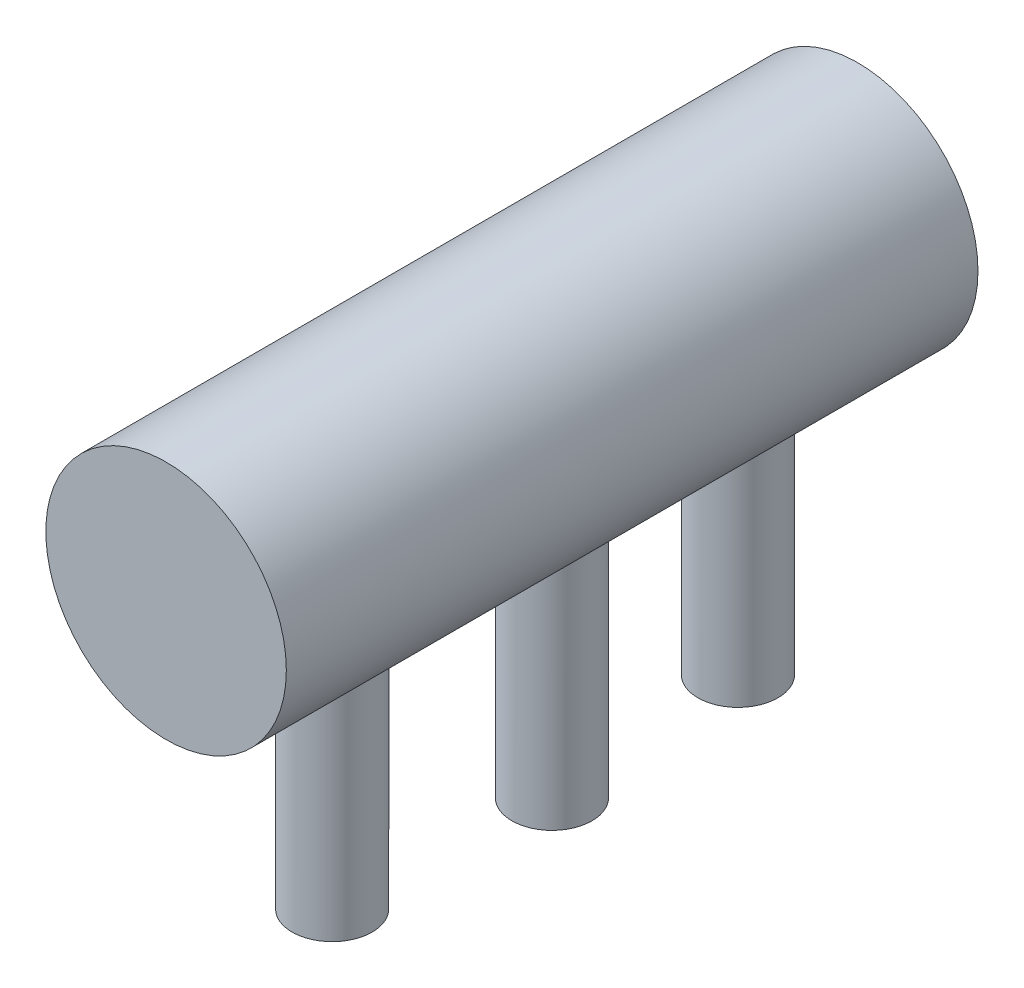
ISO-10303-21;
HEADER;
FILE_DESCRIPTION(('STEP AP214'),'2;1');
FILE_NAME('part.step','',(''),(''),'','','');
FILE_SCHEMA(('AUTOMOTIVE_DESIGN { 1 0 10303 214 1 1 1 1 }'));
ENDSEC;
DATA;
#1=APPLICATION_CONTEXT('core data for automotive mechanical design processes');
#2=APPLICATION_PROTOCOL_DEFINITION('international standard','automotive_design',2000,#1);
#3=PRODUCT_CONTEXT('',#1,'mechanical');
#4=PRODUCT('Part','Part','',(#3));
#5=PRODUCT_RELATED_PRODUCT_CATEGORY('part','',(#4));
#6=PRODUCT_DEFINITION_FORMATION('','',#4);
#7=PRODUCT_DEFINITION_CONTEXT('part definition',#1,'design');
#8=PRODUCT_DEFINITION('design','',#6,#7);
#9=PRODUCT_DEFINITION_SHAPE('','',#8);
#10=(LENGTH_UNIT() NAMED_UNIT(*) SI_UNIT(.MILLI.,.METRE.));
#11=(NAMED_UNIT(*) PLANE_ANGLE_UNIT() SI_UNIT($,.RADIAN.));
#12=(NAMED_UNIT(*) SI_UNIT($,.STERADIAN.) SOLID_ANGLE_UNIT());
#13=UNCERTAINTY_MEASURE_WITH_UNIT(LENGTH_MEASURE(1.E-05),#10,'distance_accuracy_value','');
#14=(GEOMETRIC_REPRESENTATION_CONTEXT(3) GLOBAL_UNCERTAINTY_ASSIGNED_CONTEXT((#13)) GLOBAL_UNIT_ASSIGNED_CONTEXT((#10,
#11,#12)) REPRESENTATION_CONTEXT('',''));
#15=CARTESIAN_POINT('',(0.,0.,0.));
#16=DIRECTION('',(0.,0.,1.));
#17=DIRECTION('',(1.,0.,0.));
#18=AXIS2_PLACEMENT_3D('',#15,#16,#17);
#19=CARTESIAN_POINT('',(15.9003992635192,2.49056578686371,4.318));
#20=DIRECTION('',(0.,0.,-1.));
#21=DIRECTION('',(-1.,0.,0.));
#22=AXIS2_PLACEMENT_3D('',#19,#20,#21);
#23=CYLINDRICAL_SURFACE('',#22,1.50141993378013);
#24=CARTESIAN_POINT('',(16.4003992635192,1.07484624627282,-0.499999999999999));
#25=CARTESIAN_POINT('',(16.4307310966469,1.08555940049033,-0.499999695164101));
#26=CARTESIAN_POINT('',(16.4607159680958,1.09725626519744,-0.497232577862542));
#27=CARTESIAN_POINT('',(16.5190996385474,1.12217909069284,-0.486613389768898));
#28=CARTESIAN_POINT('',(16.5474974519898,1.1354059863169,-0.478758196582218));
#29=CARTESIAN_POINT('',(16.6019446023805,1.16277796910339,-0.458497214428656));
#30=CARTESIAN_POINT('',(16.6280042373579,1.17691850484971,-0.446112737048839));
#31=CARTESIAN_POINT('',(16.677496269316,1.2055751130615,-0.417180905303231));
#32=CARTESIAN_POINT('',(16.7009264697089,1.22009148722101,-0.400630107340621));
#33=CARTESIAN_POINT('',(16.7466778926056,1.25004766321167,-0.3620288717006));
#34=CARTESIAN_POINT('',(16.7687211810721,1.26545665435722,-0.339623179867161));
#35=CARTESIAN_POINT('',(16.8085994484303,1.29472128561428,-0.290466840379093));
#36=CARTESIAN_POINT('',(16.8264408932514,1.30857929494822,-0.263722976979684));
#37=CARTESIAN_POINT('',(16.8524327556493,1.3294955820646,-0.214901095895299));
#38=CARTESIAN_POINT('',(16.8618826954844,1.337343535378,-0.193852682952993));
#39=CARTESIAN_POINT('',(16.87792220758,1.35090741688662,-0.150047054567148));
#40=CARTESIAN_POINT('',(16.8845154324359,1.35662606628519,-0.127292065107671));
#41=CARTESIAN_POINT('',(16.8944877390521,1.36535662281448,-0.0803511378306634));
#42=CARTESIAN_POINT('',(16.8978385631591,1.36834472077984,-0.0561545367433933));
#43=CARTESIAN_POINT('',(16.9009413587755,1.37110944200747,-0.00735244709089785));
#44=CARTESIAN_POINT('',(16.9006957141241,1.37088819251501,0.0172527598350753));
#45=CARTESIAN_POINT('',(16.8968984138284,1.36750952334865,0.0627961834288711));
#46=CARTESIAN_POINT('',(16.8937730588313,1.36473076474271,0.0838013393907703));
#47=CARTESIAN_POINT('',(16.8850092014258,1.35705851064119,0.12487980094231));
#48=CARTESIAN_POINT('',(16.8793689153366,1.35216351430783,0.144952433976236));
#49=CARTESIAN_POINT('',(16.8638123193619,1.33894549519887,0.189641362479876));
#50=CARTESIAN_POINT('',(16.8531206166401,1.33003449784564,0.213812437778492));
#51=CARTESIAN_POINT('',(16.8285266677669,1.31027345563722,0.259585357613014));
#52=CARTESIAN_POINT('',(16.8146199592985,1.2994207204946,0.281183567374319));
#53=CARTESIAN_POINT('',(16.7838099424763,1.27638991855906,0.321961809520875));
#54=CARTESIAN_POINT('',(16.7668621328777,1.26419338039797,0.341097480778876));
#55=CARTESIAN_POINT('',(16.7304782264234,1.23927940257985,0.376418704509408));
#56=CARTESIAN_POINT('',(16.7110420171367,1.226561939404,0.392604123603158));
#57=CARTESIAN_POINT('',(16.6656253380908,1.19845738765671,0.424955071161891));
#58=CARTESIAN_POINT('',(16.6391277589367,1.18307059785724,0.440402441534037));
#59=CARTESIAN_POINT('',(16.5833632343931,1.1530963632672,0.466336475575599));
#60=CARTESIAN_POINT('',(16.55409488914,1.13850932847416,0.476820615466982));
#61=CARTESIAN_POINT('',(16.4933056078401,1.11076741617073,0.492296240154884));
#62=CARTESIAN_POINT('',(16.461775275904,1.09761916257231,0.497263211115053));
#63=CARTESIAN_POINT('',(16.3975601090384,1.07343287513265,0.501022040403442));
#64=CARTESIAN_POINT('',(16.3648765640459,1.06239256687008,0.499820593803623));
#65=CARTESIAN_POINT('',(16.3034178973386,1.04393244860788,0.491369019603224));
#66=CARTESIAN_POINT('',(16.2746258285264,1.03624220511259,0.484830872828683));
#67=CARTESIAN_POINT('',(16.2182386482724,1.02288800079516,0.466576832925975));
#68=CARTESIAN_POINT('',(16.1906429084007,1.01722296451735,0.454863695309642));
#69=CARTESIAN_POINT('',(16.140126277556,1.00820503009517,0.4277910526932));
#70=CARTESIAN_POINT('',(16.1170080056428,1.00469072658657,0.412851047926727));
#71=CARTESIAN_POINT('',(16.0734420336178,0.998989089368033,0.37928197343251));
#72=CARTESIAN_POINT('',(16.0529941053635,0.996801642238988,0.360653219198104));
#73=CARTESIAN_POINT('',(16.0156496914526,0.993459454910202,0.320485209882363));
#74=CARTESIAN_POINT('',(15.9987122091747,0.992292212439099,0.298985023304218));
#75=CARTESIAN_POINT('',(15.9685591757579,0.990617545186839,0.253493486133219));
#76=CARTESIAN_POINT('',(15.9553439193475,0.990110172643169,0.229501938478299));
#77=CARTESIAN_POINT('',(15.9327893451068,0.989451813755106,0.179206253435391));
#78=CARTESIAN_POINT('',(15.9235284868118,0.989307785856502,0.152866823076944));
#79=CARTESIAN_POINT('',(15.9095119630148,0.989157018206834,0.0990147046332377));
#80=CARTESIAN_POINT('',(15.9047565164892,0.989150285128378,0.0715019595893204));
#81=CARTESIAN_POINT('',(15.8998600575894,0.989143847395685,0.0157997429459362));
#82=CARTESIAN_POINT('',(15.8997640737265,0.989144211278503,-0.0123936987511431));
#83=CARTESIAN_POINT('',(15.9043034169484,0.989149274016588,-0.068397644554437));
#84=CARTESIAN_POINT('',(15.9089388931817,0.989153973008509,-0.0962081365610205));
#85=CARTESIAN_POINT('',(15.9228149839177,0.989297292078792,-0.150677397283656));
#86=CARTESIAN_POINT('',(15.9320589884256,0.989436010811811,-0.177335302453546));
#87=CARTESIAN_POINT('',(15.9548902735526,0.990091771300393,-0.228718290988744));
#88=CARTESIAN_POINT('',(15.9684776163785,0.990608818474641,-0.253443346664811));
#89=CARTESIAN_POINT('',(15.9995537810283,0.9923432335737,-0.300180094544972));
#90=CARTESIAN_POINT('',(16.0170314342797,0.993558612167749,-0.322199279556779));
#91=CARTESIAN_POINT('',(16.0553740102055,0.99704174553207,-0.362960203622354));
#92=CARTESIAN_POINT('',(16.0762383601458,0.999309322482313,-0.381702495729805));
#93=CARTESIAN_POINT('',(16.1203182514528,1.00517598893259,-0.415098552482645));
#94=CARTESIAN_POINT('',(16.1434904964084,1.00875303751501,-0.429813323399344));
#95=CARTESIAN_POINT('',(16.1916886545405,1.01746997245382,-0.455171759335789));
#96=CARTESIAN_POINT('',(16.2167142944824,1.02260962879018,-0.46581602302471));
#97=CARTESIAN_POINT('',(16.268108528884,1.03462760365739,-0.482951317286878));
#98=CARTESIAN_POINT('',(16.2944899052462,1.04152664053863,-0.489389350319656));
#99=CARTESIAN_POINT('',(16.347467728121,1.05698483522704,-0.497914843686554));
#100=CARTESIAN_POINT('',(16.3740642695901,1.06554476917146,-0.500000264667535));
#101=CARTESIAN_POINT('',(16.4003992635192,1.07484624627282,-0.499999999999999));
#102=B_SPLINE_CURVE_WITH_KNOTS('',3,(#24,#25,#26,#27,#28,#29,#30,#31,#32,#33,#34,#35,#36,#37,
#38,#39,#40,#41,#42,#43,#44,#45,#46,#47,#48,#49,#50,#51,#52,#53,#54,#55,#56,#57,#58,#59,#60,#61,
#62,#63,#64,#65,#66,#67,#68,#69,#70,#71,#72,#73,#74,#75,#76,#77,#78,#79,#80,#81,#82,#83,#84,#85,
#86,#87,#88,#89,#90,#91,#92,#93,#94,#95,#96,#97,#98,#99,#100,#101),.UNSPECIFIED.,.T.,.F.,(4,2,2,
2,2,2,2,2,2,2,2,2,2,2,2,2,2,2,2,2,2,2,2,2,2,2,2,2,2,2,2,2,2,2,2,2,2,2,4),(0.,0.0963905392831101,
0.192840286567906,0.288841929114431,0.384923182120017,0.489439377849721,0.593793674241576,
0.666637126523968,0.739387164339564,0.812765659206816,0.886095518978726,0.950058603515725,
1.01406712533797,1.09729340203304,1.18063589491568,1.2653156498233,1.34999923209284,
1.45246890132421,1.55499062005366,1.65796606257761,1.76082976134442,1.85185611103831,
1.94283405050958,2.02568015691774,2.10851918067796,2.19032820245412,2.27214370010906,
2.35551455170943,2.43888945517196,2.52306992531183,2.60725304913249,2.69149818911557,
2.77574453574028,2.85975207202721,2.94374541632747,3.02638552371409,3.10901347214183,
3.19266340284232,3.27635251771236),.UNSPECIFIED.);
#103=CARTESIAN_POINT('',(16.4003992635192,1.07484624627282,-0.499999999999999));
#104=VERTEX_POINT('',#103);
#105=EDGE_CURVE('E84',#104,#104,#102,.T.);
#106=ORIENTED_EDGE('',*,*,#105,.F.);
#107=EDGE_LOOP('',(#106));
#108=FACE_BOUND('',#107,.T.);
#109=CARTESIAN_POINT('',(16.2315154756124,1.02611234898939,-2.99103587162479));
#110=CARTESIAN_POINT('',(16.2604578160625,1.0326570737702,-2.99103510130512));
#111=CARTESIAN_POINT('',(16.2892115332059,1.04006873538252,-2.9885142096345));
#112=CARTESIAN_POINT('',(16.3454791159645,1.0563321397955,-2.97871384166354));
#113=CARTESIAN_POINT('',(16.3729918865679,1.06518512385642,-2.9714302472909));
#114=CARTESIAN_POINT('',(16.4259927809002,1.08386740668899,-2.95251999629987));
#115=CARTESIAN_POINT('',(16.4514878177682,1.09369308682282,-2.94090902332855));
#116=CARTESIAN_POINT('',(16.5000492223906,1.11384007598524,-2.91372320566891));
#117=CARTESIAN_POINT('',(16.5231151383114,1.12416147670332,-2.89814762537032));
#118=CARTESIAN_POINT('',(16.567752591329,1.14537075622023,-2.86227112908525));
#119=CARTESIAN_POINT('',(16.5891372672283,1.15625316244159,-2.84173360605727));
#120=CARTESIAN_POINT('',(16.6281437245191,1.17711998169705,-2.79692543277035));
#121=CARTESIAN_POINT('',(16.6457639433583,1.18710402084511,-2.77265323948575));
#122=CARTESIAN_POINT('',(16.6764160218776,1.20511932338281,-2.72114414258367));
#123=CARTESIAN_POINT('',(16.68950308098,1.2131736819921,-2.69394860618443));
#124=CARTESIAN_POINT('',(16.710676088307,1.22649594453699,-2.63705469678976));
#125=CARTESIAN_POINT('',(16.7187717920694,1.23176928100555,-2.60736133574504));
#126=CARTESIAN_POINT('',(16.7285921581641,1.23821305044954,-2.55108806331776));
#127=CARTESIAN_POINT('',(16.7310823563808,1.23987517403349,-2.52469769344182));
#128=CARTESIAN_POINT('',(16.7318440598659,1.24038092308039,-2.47183296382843));
#129=CARTESIAN_POINT('',(16.7301176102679,1.23922591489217,-2.44535865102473));
#130=CARTESIAN_POINT('',(16.7229803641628,1.23452566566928,-2.39608960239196));
#131=CARTESIAN_POINT('',(16.717986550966,1.23125134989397,-2.3732057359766));
#132=CARTESIAN_POINT('',(16.7049845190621,1.22290505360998,-2.32866078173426));
#133=CARTESIAN_POINT('',(16.6969755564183,1.21783262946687,-2.30699999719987));
#134=CARTESIAN_POINT('',(16.6775883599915,1.20589591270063,-2.26384160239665));
#135=CARTESIAN_POINT('',(16.6660143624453,1.19893144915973,-2.24246036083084));
#136=CARTESIAN_POINT('',(16.6401159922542,1.18392697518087,-2.20185363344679));
#137=CARTESIAN_POINT('',(16.6257901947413,1.17588640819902,-2.18262927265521));
#138=CARTESIAN_POINT('',(16.5922966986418,1.15791667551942,-2.14377183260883));
#139=CARTESIAN_POINT('',(16.5727229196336,1.14788760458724,-2.12453405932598));
#140=CARTESIAN_POINT('',(16.5307444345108,1.12767541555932,-2.08952647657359));
#141=CARTESIAN_POINT('',(16.5083379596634,1.11749220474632,-2.07375885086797));
#142=CARTESIAN_POINT('',(16.4589548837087,1.09662952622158,-2.04475859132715));
#143=CARTESIAN_POINT('',(16.4317479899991,1.08598911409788,-2.03188676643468));
#144=CARTESIAN_POINT('',(16.3750916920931,1.06584423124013,-2.01114527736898));
#145=CARTESIAN_POINT('',(16.3456428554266,1.05633947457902,-2.00327435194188));
#146=CARTESIAN_POINT('',(16.2864639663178,1.03931549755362,-1.99319365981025));
#147=CARTESIAN_POINT('',(16.2567865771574,1.03173482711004,-1.99078123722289));
#148=CARTESIAN_POINT('',(16.1970695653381,1.01843051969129,-1.99133259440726));
#149=CARTESIAN_POINT('',(16.1670301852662,1.01270570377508,-1.9942929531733));
#150=CARTESIAN_POINT('',(16.1102272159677,1.00362563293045,-2.00518287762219));
#151=CARTESIAN_POINT('',(16.0834030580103,1.00010969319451,-2.01266618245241));
#152=CARTESIAN_POINT('',(16.031237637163,0.994627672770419,-2.03205598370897));
#153=CARTESIAN_POINT('',(16.0058961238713,0.992661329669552,-2.04396173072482));
#154=CARTESIAN_POINT('',(15.9583469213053,0.990081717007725,-2.07138542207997));
#155=CARTESIAN_POINT('',(15.9360612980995,0.989424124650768,-2.08676463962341));
#156=CARTESIAN_POINT('',(15.8942576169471,0.989012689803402,-2.12091993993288));
#157=CARTESIAN_POINT('',(15.8747398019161,0.989258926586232,-2.1396963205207));
#158=CARTESIAN_POINT('',(15.8386426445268,0.99030541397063,-2.18053903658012));
#159=CARTESIAN_POINT('',(15.8221286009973,0.991116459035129,-2.20266278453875));
#160=CARTESIAN_POINT('',(15.7929615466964,0.992923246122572,-2.24931802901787));
#161=CARTESIAN_POINT('',(15.7803089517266,0.99391900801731,-2.27384978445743));
#162=CARTESIAN_POINT('',(15.7589837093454,0.995781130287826,-2.32519729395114));
#163=CARTESIAN_POINT('',(15.7503997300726,0.996644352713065,-2.35205005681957));
#164=CARTESIAN_POINT('',(15.737857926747,0.997956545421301,-2.4068244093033));
#165=CARTESIAN_POINT('',(15.733899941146,0.998405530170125,-2.43474596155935));
#166=CARTESIAN_POINT('',(15.73073000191,0.998762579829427,-2.49079763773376));
#167=CARTESIAN_POINT('',(15.7315073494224,0.998671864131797,-2.51892714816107));
#168=CARTESIAN_POINT('',(15.7377600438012,0.997977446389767,-2.57465240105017));
#169=CARTESIAN_POINT('',(15.7432354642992,0.997373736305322,-2.60224813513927));
#170=CARTESIAN_POINT('',(15.7587047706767,0.995826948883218,-2.65605655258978));
#171=CARTESIAN_POINT('',(15.768687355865,0.994884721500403,-2.68227251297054));
#172=CARTESIAN_POINT('',(15.7928879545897,0.992951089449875,-2.73267072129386));
#173=CARTESIAN_POINT('',(15.8071062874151,0.991959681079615,-2.75685281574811));
#174=CARTESIAN_POINT('',(15.8394873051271,0.990294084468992,-2.80265296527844));
#175=CARTESIAN_POINT('',(15.8576736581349,0.989621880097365,-2.82425437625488));
#176=CARTESIAN_POINT('',(15.8974270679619,0.989017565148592,-2.8640997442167));
#177=CARTESIAN_POINT('',(15.9189939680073,0.989085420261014,-2.88234385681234));
#178=CARTESIAN_POINT('',(15.9646026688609,0.990347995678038,-2.91474689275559));
#179=CARTESIAN_POINT('',(15.9886129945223,0.991529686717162,-2.928950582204));
#180=CARTESIAN_POINT('',(16.0385604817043,0.995307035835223,-2.95313686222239));
#181=CARTESIAN_POINT('',(16.0644965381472,0.997901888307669,-2.96312185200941));
#182=CARTESIAN_POINT('',(16.1139447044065,1.00422892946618,-2.97760617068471));
#183=CARTESIAN_POINT('',(16.1373224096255,1.00776476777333,-2.98265720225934));
#184=CARTESIAN_POINT('',(16.1843467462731,1.01604689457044,-2.98937254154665));
#185=CARTESIAN_POINT('',(16.207993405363,1.02079330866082,-2.99103649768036));
#186=CARTESIAN_POINT('',(16.2315154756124,1.02611234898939,-2.99103587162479));
#187=B_SPLINE_CURVE_WITH_KNOTS('',3,(#109,#110,#111,#112,#113,#114,#115,#116,#117,#118,#119,
#120,#121,#122,#123,#124,#125,#126,#127,#128,#129,#130,#131,#132,#133,#134,#135,#136,#137,#138,
#139,#140,#141,#142,#143,#144,#145,#146,#147,#148,#149,#150,#151,#152,#153,#154,#155,#156,#157,
#158,#159,#160,#161,#162,#163,#164,#165,#166,#167,#168,#169,#170,#171,#172,#173,#174,#175,#176,
#177,#178,#179,#180,#181,#182,#183,#184,#185,#186),.UNSPECIFIED.,.T.,.F.,(4,2,2,2,2,2,2,2,2,2,2,
2,2,2,2,2,2,2,2,2,2,2,2,2,2,2,2,2,2,2,2,2,2,2,2,2,2,2,4),(0.,0.0889238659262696,
0.177924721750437,0.266606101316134,0.35530394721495,0.449613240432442,0.543961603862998,
0.637117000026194,0.730089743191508,0.809303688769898,0.888479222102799,0.959124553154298,
1.02978732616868,1.10537008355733,1.18099208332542,1.26829170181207,1.35564610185,
1.45094252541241,1.54621490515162,1.63788767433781,1.72950209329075,1.81328761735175,
1.89705894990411,1.97794139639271,2.05883093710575,2.14131042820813,2.22379879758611,
2.3080104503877,2.39221916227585,2.4762376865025,2.5602575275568,2.6440678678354,
2.72788452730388,2.81221550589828,2.89654257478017,2.9798952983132,3.06320055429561,
3.13546341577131,3.20773377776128),.UNSPECIFIED.);
#188=CARTESIAN_POINT('',(16.2315154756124,1.02611234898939,-2.99103587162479));
#189=VERTEX_POINT('',#188);
#190=EDGE_CURVE('E88',#189,#189,#187,.T.);
#191=ORIENTED_EDGE('',*,*,#190,.F.);
#192=EDGE_LOOP('',(#191));
#193=FACE_BOUND('',#192,.T.);
#194=CARTESIAN_POINT('',(16.2315154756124,1.02611234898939,2.07547776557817));
#195=CARTESIAN_POINT('',(16.2604578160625,1.0326570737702,2.07547853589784));
#196=CARTESIAN_POINT('',(16.2892115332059,1.04006873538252,2.07799942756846));
#197=CARTESIAN_POINT('',(16.3454791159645,1.0563321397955,2.08779979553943));
#198=CARTESIAN_POINT('',(16.3729918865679,1.06518512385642,2.09508338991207));
#199=CARTESIAN_POINT('',(16.4259927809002,1.08386740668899,2.1139936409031));
#200=CARTESIAN_POINT('',(16.4514878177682,1.09369308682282,2.12560461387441));
#201=CARTESIAN_POINT('',(16.5000492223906,1.11384007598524,2.15279043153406));
#202=CARTESIAN_POINT('',(16.5231151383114,1.12416147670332,2.16836601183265));
#203=CARTESIAN_POINT('',(16.567752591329,1.14537075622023,2.20424250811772));
#204=CARTESIAN_POINT('',(16.5891372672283,1.15625316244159,2.22478003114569));
#205=CARTESIAN_POINT('',(16.6281437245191,1.17711998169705,2.26958820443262));
#206=CARTESIAN_POINT('',(16.6457639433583,1.18710402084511,2.29386039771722));
#207=CARTESIAN_POINT('',(16.6764160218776,1.20511932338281,2.3453694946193));
#208=CARTESIAN_POINT('',(16.68950308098,1.2131736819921,2.37256503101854));
#209=CARTESIAN_POINT('',(16.710676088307,1.22649594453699,2.42945894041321));
#210=CARTESIAN_POINT('',(16.7187717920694,1.23176928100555,2.45915230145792));
#211=CARTESIAN_POINT('',(16.7285921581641,1.23821305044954,2.51542557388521));
#212=CARTESIAN_POINT('',(16.7310823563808,1.23987517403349,2.54181594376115));
#213=CARTESIAN_POINT('',(16.7318440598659,1.24038092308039,2.59468067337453));
#214=CARTESIAN_POINT('',(16.7301176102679,1.23922591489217,2.62115498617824));
#215=CARTESIAN_POINT('',(16.7229803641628,1.23452566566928,2.670424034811));
#216=CARTESIAN_POINT('',(16.717986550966,1.23125134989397,2.69330790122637));
#217=CARTESIAN_POINT('',(16.7049845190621,1.22290505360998,2.73785285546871));
#218=CARTESIAN_POINT('',(16.6969755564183,1.21783262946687,2.7595136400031));
#219=CARTESIAN_POINT('',(16.6775883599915,1.20589591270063,2.80267203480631));
#220=CARTESIAN_POINT('',(16.6660143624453,1.19893144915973,2.82405327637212));
#221=CARTESIAN_POINT('',(16.6401159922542,1.18392697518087,2.86466000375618));
#222=CARTESIAN_POINT('',(16.6257901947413,1.17588640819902,2.88388436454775));
#223=CARTESIAN_POINT('',(16.5922966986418,1.15791667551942,2.92274180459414));
#224=CARTESIAN_POINT('',(16.5727229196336,1.14788760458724,2.94197957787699));
#225=CARTESIAN_POINT('',(16.5307444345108,1.12767541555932,2.97698716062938));
#226=CARTESIAN_POINT('',(16.5083379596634,1.11749220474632,2.992754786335));
#227=CARTESIAN_POINT('',(16.4589548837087,1.09662952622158,3.02175504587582));
#228=CARTESIAN_POINT('',(16.4317479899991,1.08598911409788,3.03462687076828));
#229=CARTESIAN_POINT('',(16.3750916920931,1.06584423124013,3.05536835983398));
#230=CARTESIAN_POINT('',(16.3456428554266,1.05633947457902,3.06323928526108));
#231=CARTESIAN_POINT('',(16.2864639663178,1.03931549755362,3.07331997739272));
#232=CARTESIAN_POINT('',(16.2567865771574,1.03173482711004,3.07573239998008));
#233=CARTESIAN_POINT('',(16.1970695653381,1.01843051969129,3.07518104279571));
#234=CARTESIAN_POINT('',(16.1670301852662,1.01270570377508,3.07222068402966));
#235=CARTESIAN_POINT('',(16.1102272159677,1.00362563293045,3.06133075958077));
#236=CARTESIAN_POINT('',(16.0834030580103,1.00010969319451,3.05384745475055));
#237=CARTESIAN_POINT('',(16.031237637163,0.994627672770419,3.034457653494));
#238=CARTESIAN_POINT('',(16.0058961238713,0.992661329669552,3.02255190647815));
#239=CARTESIAN_POINT('',(15.9583469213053,0.990081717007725,2.995128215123));
#240=CARTESIAN_POINT('',(15.9360612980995,0.989424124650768,2.97974899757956));
#241=CARTESIAN_POINT('',(15.8942576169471,0.989012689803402,2.94559369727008));
#242=CARTESIAN_POINT('',(15.8747398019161,0.989258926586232,2.92681731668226));
#243=CARTESIAN_POINT('',(15.8386426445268,0.99030541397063,2.88597460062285));
#244=CARTESIAN_POINT('',(15.8221286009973,0.991116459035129,2.86385085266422));
#245=CARTESIAN_POINT('',(15.7929615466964,0.992923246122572,2.81719560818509));
#246=CARTESIAN_POINT('',(15.7803089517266,0.99391900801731,2.79266385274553));
#247=CARTESIAN_POINT('',(15.7589837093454,0.995781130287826,2.74131634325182));
#248=CARTESIAN_POINT('',(15.7503997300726,0.996644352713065,2.71446358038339));
#249=CARTESIAN_POINT('',(15.737857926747,0.997956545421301,2.65968922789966));
#250=CARTESIAN_POINT('',(15.733899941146,0.998405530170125,2.63176767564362));
#251=CARTESIAN_POINT('',(15.73073000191,0.998762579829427,2.57571599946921));
#252=CARTESIAN_POINT('',(15.7315073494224,0.998671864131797,2.5475864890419));
#253=CARTESIAN_POINT('',(15.7377600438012,0.997977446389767,2.4918612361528));
#254=CARTESIAN_POINT('',(15.7432354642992,0.997373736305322,2.4642655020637));
#255=CARTESIAN_POINT('',(15.7587047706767,0.995826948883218,2.41045708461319));
#256=CARTESIAN_POINT('',(15.768687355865,0.994884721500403,2.38424112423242));
#257=CARTESIAN_POINT('',(15.7928879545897,0.992951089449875,2.33384291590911));
#258=CARTESIAN_POINT('',(15.8071062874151,0.991959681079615,2.30966082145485));
#259=CARTESIAN_POINT('',(15.8394873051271,0.990294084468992,2.26386067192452));
#260=CARTESIAN_POINT('',(15.8576736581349,0.989621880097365,2.24225926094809));
#261=CARTESIAN_POINT('',(15.8974270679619,0.989017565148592,2.20241389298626));
#262=CARTESIAN_POINT('',(15.9189939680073,0.989085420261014,2.18416978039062));
#263=CARTESIAN_POINT('',(15.9646026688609,0.990347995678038,2.15176674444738));
#264=CARTESIAN_POINT('',(15.9886129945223,0.991529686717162,2.13756305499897));
#265=CARTESIAN_POINT('',(16.0385604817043,0.995307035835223,2.11337677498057));
#266=CARTESIAN_POINT('',(16.0644965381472,0.997901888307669,2.10339178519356));
#267=CARTESIAN_POINT('',(16.1139447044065,1.00422892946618,2.08890746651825));
#268=CARTESIAN_POINT('',(16.1373224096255,1.00776476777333,2.08385643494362));
#269=CARTESIAN_POINT('',(16.1843467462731,1.01604689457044,2.07714109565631));
#270=CARTESIAN_POINT('',(16.207993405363,1.02079330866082,2.07547713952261));
#271=CARTESIAN_POINT('',(16.2315154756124,1.02611234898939,2.07547776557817));
#272=B_SPLINE_CURVE_WITH_KNOTS('',3,(#194,#195,#196,#197,#198,#199,#200,#201,#202,#203,#204,
#205,#206,#207,#208,#209,#210,#211,#212,#213,#214,#215,#216,#217,#218,#219,#220,#221,#222,#223,
#224,#225,#226,#227,#228,#229,#230,#231,#232,#233,#234,#235,#236,#237,#238,#239,#240,#241,#242,
#243,#244,#245,#246,#247,#248,#249,#250,#251,#252,#253,#254,#255,#256,#257,#258,#259,#260,#261,
#262,#263,#264,#265,#266,#267,#268,#269,#270,#271),.UNSPECIFIED.,.T.,.F.,(4,2,2,2,2,2,2,2,2,2,2,
2,2,2,2,2,2,2,2,2,2,2,2,2,2,2,2,2,2,2,2,2,2,2,2,2,2,2,4),(0.,0.0889238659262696,
0.177924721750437,0.266606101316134,0.35530394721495,0.449613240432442,0.543961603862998,
0.637117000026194,0.730089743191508,0.809303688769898,0.888479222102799,0.959124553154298,
1.02978732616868,1.10537008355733,1.18099208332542,1.26829170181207,1.35564610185,
1.45094252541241,1.54621490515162,1.63788767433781,1.72950209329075,1.81328761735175,
1.89705894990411,1.97794139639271,2.05883093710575,2.14131042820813,2.22379879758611,
2.3080104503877,2.39221916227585,2.4762376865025,2.5602575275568,2.6440678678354,
2.72788452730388,2.81221550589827,2.89654257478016,2.9798952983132,3.06320055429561,
3.13546341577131,3.20773377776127),.UNSPECIFIED.);
#273=CARTESIAN_POINT('',(16.2315154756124,1.02611234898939,2.07547776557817));
#274=VERTEX_POINT('',#273);
#275=EDGE_CURVE('E39',#274,#274,#272,.T.);
#276=ORIENTED_EDGE('',*,*,#275,.F.);
#277=EDGE_LOOP('',(#276));
#278=FACE_BOUND('',#277,.T.);
#279=CARTESIAN_POINT('',(15.9003992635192,2.49056578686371,4.318));
#280=DIRECTION('',(0.,0.,1.));
#281=DIRECTION('',(1.,0.,0.));
#282=AXIS2_PLACEMENT_3D('',#279,#280,#281);
#283=CIRCLE('',#282,1.50141993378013);
#284=CARTESIAN_POINT('',(17.4018191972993,2.49056578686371,4.318));
#285=VERTEX_POINT('',#284);
#286=EDGE_CURVE('E10',#285,#285,#283,.T.);
#287=ORIENTED_EDGE('',*,*,#286,.F.);
#288=EDGE_LOOP('',(#287));
#289=FACE_BOUND('',#288,.T.);
#290=CARTESIAN_POINT('',(15.9003992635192,2.49056578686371,-4.318));
#291=DIRECTION('',(0.,0.,1.));
#292=DIRECTION('',(1.,0.,0.));
#293=AXIS2_PLACEMENT_3D('',#290,#291,#292);
#294=CIRCLE('',#293,1.50141993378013);
#295=CARTESIAN_POINT('',(17.4018191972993,2.49056578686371,-4.318));
#296=VERTEX_POINT('',#295);
#297=EDGE_CURVE('E35',#296,#296,#294,.T.);
#298=ORIENTED_EDGE('',*,*,#297,.T.);
#299=EDGE_LOOP('',(#298));
#300=FACE_BOUND('',#299,.T.);
#301=ADVANCED_FACE('F29',(#108,#193,#278,#289,#300),#23,.T.);
#302=CARTESIAN_POINT('',(15.9003992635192,2.49056578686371,4.318));
#303=DIRECTION('',(0.,0.,1.));
#304=DIRECTION('',(1.,0.,0.));
#305=AXIS2_PLACEMENT_3D('',#302,#303,#304);
#306=PLANE('',#305);
#307=ORIENTED_EDGE('',*,*,#286,.T.);
#308=EDGE_LOOP('',(#307));
#309=FACE_BOUND('',#308,.T.);
#310=ADVANCED_FACE('F71',(#309),#306,.T.);
#311=CARTESIAN_POINT('',(15.9003992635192,2.49056578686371,-4.318));
#312=DIRECTION('',(0.,0.,1.));
#313=DIRECTION('',(1.,0.,0.));
#314=AXIS2_PLACEMENT_3D('',#311,#312,#313);
#315=PLANE('',#314);
#316=ORIENTED_EDGE('',*,*,#297,.F.);
#317=EDGE_LOOP('',(#316));
#318=FACE_BOUND('',#317,.T.);
#319=ADVANCED_FACE('F62',(#318),#315,.F.);
#320=CARTESIAN_POINT('',(16.2315154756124,-1.54731199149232,2.57547776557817));
#321=DIRECTION('',(0.,-1.,0.));
#322=DIRECTION('',(0.,0.,-1.));
#323=AXIS2_PLACEMENT_3D('',#320,#321,#322);
#324=PLANE('',#323);
#325=CARTESIAN_POINT('',(16.2315154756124,-1.54731199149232,2.57547776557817));
#326=DIRECTION('',(0.,-1.,0.));
#327=DIRECTION('',(0.,0.,-1.));
#328=AXIS2_PLACEMENT_3D('',#325,#326,#327);
#329=CIRCLE('',#328,0.499999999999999);
#330=CARTESIAN_POINT('',(16.2315154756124,-1.54731199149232,2.07547776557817));
#331=VERTEX_POINT('',#330);
#332=EDGE_CURVE('E43',#331,#331,#329,.T.);
#333=ORIENTED_EDGE('',*,*,#332,.T.);
#334=EDGE_LOOP('',(#333));
#335=FACE_BOUND('',#334,.T.);
#336=ADVANCED_FACE('F60',(#335),#324,.T.);
#337=CARTESIAN_POINT('',(16.2315154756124,500000.,2.57547776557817));
#338=DIRECTION('',(0.,-1.,0.));
#339=DIRECTION('',(0.,0.,-1.));
#340=AXIS2_PLACEMENT_3D('',#337,#338,#339);
#341=CYLINDRICAL_SURFACE('',#340,0.499999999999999);
#342=ORIENTED_EDGE('',*,*,#332,.F.);
#343=EDGE_LOOP('',(#342));
#344=FACE_BOUND('',#343,.T.);
#345=ORIENTED_EDGE('',*,*,#275,.T.);
#346=EDGE_LOOP('',(#345));
#347=FACE_BOUND('',#346,.T.);
#348=ADVANCED_FACE('F51',(#344,#347),#341,.T.);
#349=CARTESIAN_POINT('',(16.2315154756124,-1.54731199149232,-2.49103587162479));
#350=DIRECTION('',(0.,-1.,0.));
#351=DIRECTION('',(0.,0.,-1.));
#352=AXIS2_PLACEMENT_3D('',#349,#350,#351);
#353=PLANE('',#352);
#354=CARTESIAN_POINT('',(16.2315154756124,-1.54731199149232,-2.49103587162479));
#355=DIRECTION('',(0.,-1.,0.));
#356=DIRECTION('',(0.,0.,-1.));
#357=AXIS2_PLACEMENT_3D('',#354,#355,#356);
#358=CIRCLE('',#357,0.499999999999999);
#359=CARTESIAN_POINT('',(16.2315154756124,-1.54731199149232,-2.99103587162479));
#360=VERTEX_POINT('',#359);
#361=EDGE_CURVE('E93',#360,#360,#358,.T.);
#362=ORIENTED_EDGE('',*,*,#361,.T.);
#363=EDGE_LOOP('',(#362));
#364=FACE_BOUND('',#363,.T.);
#365=ADVANCED_FACE('F68',(#364),#353,.T.);
#366=CARTESIAN_POINT('',(16.2315154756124,500000.,-2.49103587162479));
#367=DIRECTION('',(0.,-1.,0.));
#368=DIRECTION('',(0.,0.,-1.));
#369=AXIS2_PLACEMENT_3D('',#366,#367,#368);
#370=CYLINDRICAL_SURFACE('',#369,0.499999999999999);
#371=ORIENTED_EDGE('',*,*,#361,.F.);
#372=EDGE_LOOP('',(#371));
#373=FACE_BOUND('',#372,.T.);
#374=ORIENTED_EDGE('',*,*,#190,.T.);
#375=EDGE_LOOP('',(#374));
#376=FACE_BOUND('',#375,.T.);
#377=ADVANCED_FACE('F57',(#373,#376),#370,.T.);
#378=CARTESIAN_POINT('',(16.4003992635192,-1.54731199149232,0.));
#379=DIRECTION('',(0.,-1.,0.));
#380=DIRECTION('',(0.,0.,-1.));
#381=AXIS2_PLACEMENT_3D('',#378,#379,#380);
#382=PLANE('',#381);
#383=CARTESIAN_POINT('',(16.4003992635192,-1.54731199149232,0.));
#384=DIRECTION('',(0.,-1.,0.));
#385=DIRECTION('',(0.,0.,-1.));
#386=AXIS2_PLACEMENT_3D('',#383,#384,#385);
#387=CIRCLE('',#386,0.499999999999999);
#388=CARTESIAN_POINT('',(16.4003992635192,-1.54731199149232,-0.499999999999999));
#389=VERTEX_POINT('',#388);
#390=EDGE_CURVE('E118',#389,#389,#387,.T.);
#391=ORIENTED_EDGE('',*,*,#390,.T.);
#392=EDGE_LOOP('',(#391));
#393=FACE_BOUND('',#392,.T.);
#394=ADVANCED_FACE('F75',(#393),#382,.T.);
#395=CARTESIAN_POINT('',(16.4003992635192,500000.,0.));
#396=DIRECTION('',(0.,-1.,0.));
#397=DIRECTION('',(0.,0.,-1.));
#398=AXIS2_PLACEMENT_3D('',#395,#396,#397);
#399=CYLINDRICAL_SURFACE('',#398,0.499999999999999);
#400=ORIENTED_EDGE('',*,*,#390,.F.);
#401=EDGE_LOOP('',(#400));
#402=FACE_BOUND('',#401,.T.);
#403=ORIENTED_EDGE('',*,*,#105,.T.);
#404=EDGE_LOOP('',(#403));
#405=FACE_BOUND('',#404,.T.);
#406=ADVANCED_FACE('F102',(#402,#405),#399,.T.);
#407=CLOSED_SHELL('',(#301,#310,#319,#336,#348,#365,#377,#394,#406));
#408=MANIFOLD_SOLID_BREP('B2',#407);
#409=ADVANCED_BREP_SHAPE_REPRESENTATION('',(#18,#408),#14);
#410=SHAPE_DEFINITION_REPRESENTATION(#9,#409);
ENDSEC;
END-ISO-10303-21;
